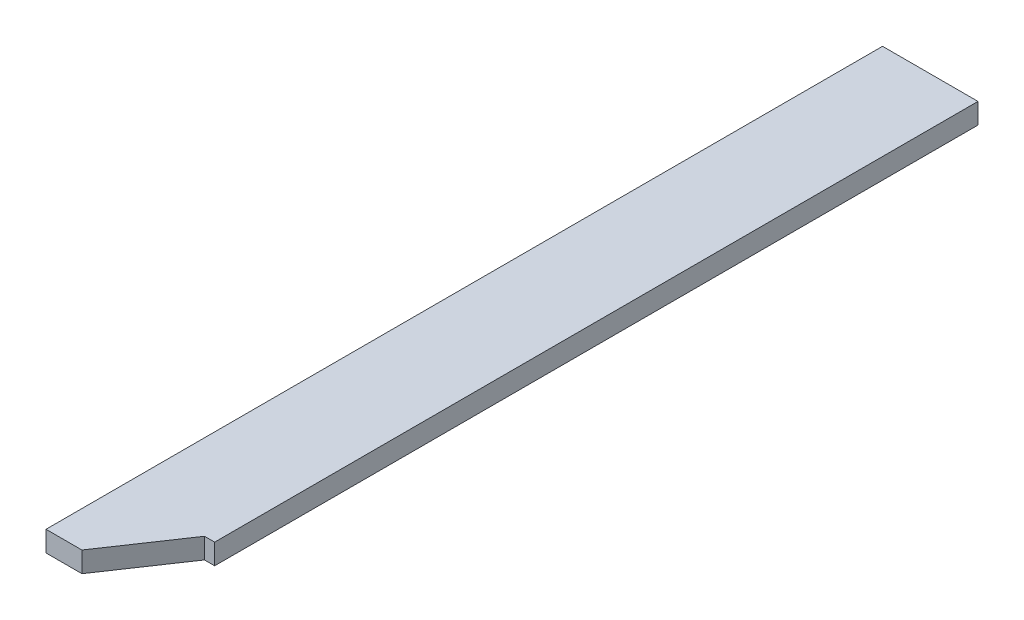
from build123d import *

# Parameters (mm, degrees)
SKETCH1_W           = 590.55
SKETCH1_H           = 5175.34144
BOSS_EXTRUDE1_DEPTH = 127
CUT_EXTRUDE1_DEPTH  = 2608.557493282


with BuildPart() as part:
    # Sketch1 → Boss-Extrude1 (new body)
    with BuildSketch(Plane(origin=(0, 0, 0), x_dir=(1, 0, 0), z_dir=(0, 1, 0))):
        Rectangle(SKETCH1_W, SKETCH1_H)
    extrude(amount=BOSS_EXTRUDE1_DEPTH)

    # Sketch2 → Cut-Extrude1 (cut, through all)
    with BuildSketch(Plane.XZ):
        Polygon((295.275, 2587.67072), (295.275, 2134.933301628), (232.350244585, 2134.933301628), (-73.025, 2587.67072), align=None)
    extrude(amount=-CUT_EXTRUDE1_DEPTH, mode=Mode.SUBTRACT)


solid = part.part
